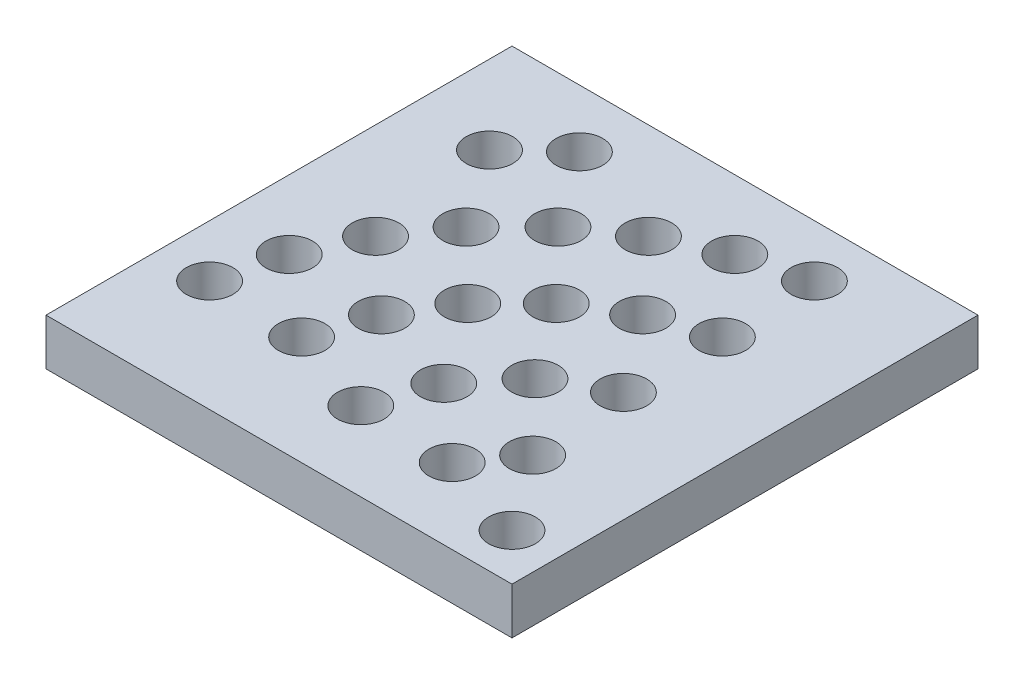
ISO-10303-21;
HEADER;
FILE_DESCRIPTION(('STEP AP214'),'2;1');
FILE_NAME('part.step','',(''),(''),'','','');
FILE_SCHEMA(('AUTOMOTIVE_DESIGN { 1 0 10303 214 1 1 1 1 }'));
ENDSEC;
DATA;
#1=APPLICATION_CONTEXT('core data for automotive mechanical design processes');
#2=APPLICATION_PROTOCOL_DEFINITION('international standard','automotive_design',2000,#1);
#3=PRODUCT_CONTEXT('',#1,'mechanical');
#4=PRODUCT('Part','Part','',(#3));
#5=PRODUCT_RELATED_PRODUCT_CATEGORY('part','',(#4));
#6=PRODUCT_DEFINITION_FORMATION('','',#4);
#7=PRODUCT_DEFINITION_CONTEXT('part definition',#1,'design');
#8=PRODUCT_DEFINITION('design','',#6,#7);
#9=PRODUCT_DEFINITION_SHAPE('','',#8);
#10=(LENGTH_UNIT() NAMED_UNIT(*) SI_UNIT(.MILLI.,.METRE.));
#11=(NAMED_UNIT(*) PLANE_ANGLE_UNIT() SI_UNIT($,.RADIAN.));
#12=(NAMED_UNIT(*) SI_UNIT($,.STERADIAN.) SOLID_ANGLE_UNIT());
#13=UNCERTAINTY_MEASURE_WITH_UNIT(LENGTH_MEASURE(1.E-05),#10,'distance_accuracy_value','');
#14=(GEOMETRIC_REPRESENTATION_CONTEXT(3) GLOBAL_UNCERTAINTY_ASSIGNED_CONTEXT((#13)) GLOBAL_UNIT_ASSIGNED_CONTEXT((#10,
#11,#12)) REPRESENTATION_CONTEXT('',''));
#15=CARTESIAN_POINT('',(0.,0.,0.));
#16=DIRECTION('',(0.,0.,1.));
#17=DIRECTION('',(1.,0.,0.));
#18=AXIS2_PLACEMENT_3D('',#15,#16,#17);
#19=CARTESIAN_POINT('',(0.,5.,0.));
#20=DIRECTION('',(-1.,0.,0.));
#21=DIRECTION('',(0.,0.,1.));
#22=AXIS2_PLACEMENT_3D('',#19,#20,#21);
#23=PLANE('',#22);
#24=DIRECTION('',(0.,0.,-1.));
#25=VECTOR('',#24,1.);
#26=CARTESIAN_POINT('',(0.,0.,0.));
#27=LINE('',#26,#25);
#28=CARTESIAN_POINT('',(0.,0.,0.));
#29=VERTEX_POINT('',#28);
#30=CARTESIAN_POINT('',(0.,0.,-50.));
#31=VERTEX_POINT('',#30);
#32=EDGE_CURVE('E82',#29,#31,#27,.T.);
#33=ORIENTED_EDGE('',*,*,#32,.T.);
#34=DIRECTION('',(0.,-1.,0.));
#35=VECTOR('',#34,1.);
#36=CARTESIAN_POINT('',(0.,5.,-50.));
#37=LINE('',#36,#35);
#38=CARTESIAN_POINT('',(0.,5.,-50.));
#39=VERTEX_POINT('',#38);
#40=EDGE_CURVE('E89',#39,#31,#37,.T.);
#41=ORIENTED_EDGE('',*,*,#40,.F.);
#42=DIRECTION('',(0.,0.,-1.));
#43=VECTOR('',#42,1.);
#44=CARTESIAN_POINT('',(0.,5.,0.));
#45=LINE('',#44,#43);
#46=CARTESIAN_POINT('',(0.,5.,0.));
#47=VERTEX_POINT('',#46);
#48=EDGE_CURVE('E110',#47,#39,#45,.T.);
#49=ORIENTED_EDGE('',*,*,#48,.F.);
#50=DIRECTION('',(0.,-1.,0.));
#51=VECTOR('',#50,1.);
#52=CARTESIAN_POINT('',(0.,5.,0.));
#53=LINE('',#52,#51);
#54=EDGE_CURVE('E98',#47,#29,#53,.T.);
#55=ORIENTED_EDGE('',*,*,#54,.T.);
#56=EDGE_LOOP('',(#33,#41,#49,#55));
#57=FACE_BOUND('',#56,.T.);
#58=ADVANCED_FACE('F35',(#57),#23,.F.);
#59=CARTESIAN_POINT('',(0.,5.,-50.));
#60=DIRECTION('',(0.,0.,1.));
#61=DIRECTION('',(1.,0.,0.));
#62=AXIS2_PLACEMENT_3D('',#59,#60,#61);
#63=PLANE('',#62);
#64=DIRECTION('',(-1.,0.,0.));
#65=VECTOR('',#64,1.);
#66=CARTESIAN_POINT('',(0.,0.,-50.));
#67=LINE('',#66,#65);
#68=CARTESIAN_POINT('',(-50.,0.,-50.));
#69=VERTEX_POINT('',#68);
#70=EDGE_CURVE('E76',#31,#69,#67,.T.);
#71=ORIENTED_EDGE('',*,*,#70,.T.);
#72=DIRECTION('',(0.,-1.,0.));
#73=VECTOR('',#72,1.);
#74=CARTESIAN_POINT('',(-50.,5.,-50.));
#75=LINE('',#74,#73);
#76=CARTESIAN_POINT('',(-50.,5.,-50.));
#77=VERTEX_POINT('',#76);
#78=EDGE_CURVE('E95',#77,#69,#75,.T.);
#79=ORIENTED_EDGE('',*,*,#78,.F.);
#80=DIRECTION('',(-1.,0.,0.));
#81=VECTOR('',#80,1.);
#82=CARTESIAN_POINT('',(0.,5.,-50.));
#83=LINE('',#82,#81);
#84=EDGE_CURVE('E91',#39,#77,#83,.T.);
#85=ORIENTED_EDGE('',*,*,#84,.F.);
#86=ORIENTED_EDGE('',*,*,#40,.T.);
#87=EDGE_LOOP('',(#71,#79,#85,#86));
#88=FACE_BOUND('',#87,.T.);
#89=ADVANCED_FACE('F90',(#88),#63,.F.);
#90=CARTESIAN_POINT('',(-50.,5.,0.));
#91=DIRECTION('',(1.,0.,0.));
#92=DIRECTION('',(0.,0.,-1.));
#93=AXIS2_PLACEMENT_3D('',#90,#91,#92);
#94=PLANE('',#93);
#95=DIRECTION('',(0.,0.,1.));
#96=VECTOR('',#95,1.);
#97=CARTESIAN_POINT('',(-50.,0.,0.));
#98=LINE('',#97,#96);
#99=CARTESIAN_POINT('',(-50.,0.,0.));
#100=VERTEX_POINT('',#99);
#101=EDGE_CURVE('E83',#69,#100,#98,.T.);
#102=ORIENTED_EDGE('',*,*,#101,.T.);
#103=DIRECTION('',(0.,-1.,0.));
#104=VECTOR('',#103,1.);
#105=CARTESIAN_POINT('',(-50.,5.,0.));
#106=LINE('',#105,#104);
#107=CARTESIAN_POINT('',(-50.,5.,0.));
#108=VERTEX_POINT('',#107);
#109=EDGE_CURVE('E116',#108,#100,#106,.T.);
#110=ORIENTED_EDGE('',*,*,#109,.F.);
#111=DIRECTION('',(0.,0.,1.));
#112=VECTOR('',#111,1.);
#113=CARTESIAN_POINT('',(-50.,5.,0.));
#114=LINE('',#113,#112);
#115=EDGE_CURVE('E55',#77,#108,#114,.T.);
#116=ORIENTED_EDGE('',*,*,#115,.F.);
#117=ORIENTED_EDGE('',*,*,#78,.T.);
#118=EDGE_LOOP('',(#102,#110,#116,#117));
#119=FACE_BOUND('',#118,.T.);
#120=ADVANCED_FACE('F255',(#119),#94,.F.);
#121=CARTESIAN_POINT('',(0.,5.,0.));
#122=DIRECTION('',(0.,0.,-1.));
#123=DIRECTION('',(-1.,0.,0.));
#124=AXIS2_PLACEMENT_3D('',#121,#122,#123);
#125=PLANE('',#124);
#126=DIRECTION('',(1.,0.,0.));
#127=VECTOR('',#126,1.);
#128=CARTESIAN_POINT('',(0.,0.,0.));
#129=LINE('',#128,#127);
#130=EDGE_CURVE('E108',#100,#29,#129,.T.);
#131=ORIENTED_EDGE('',*,*,#130,.T.);
#132=ORIENTED_EDGE('',*,*,#54,.F.);
#133=DIRECTION('',(1.,0.,0.));
#134=VECTOR('',#133,1.);
#135=CARTESIAN_POINT('',(0.,5.,0.));
#136=LINE('',#135,#134);
#137=EDGE_CURVE('E50',#108,#47,#136,.T.);
#138=ORIENTED_EDGE('',*,*,#137,.F.);
#139=ORIENTED_EDGE('',*,*,#109,.T.);
#140=EDGE_LOOP('',(#131,#132,#138,#139));
#141=FACE_BOUND('',#140,.T.);
#142=ADVANCED_FACE('F245',(#141),#125,.F.);
#143=CARTESIAN_POINT('',(0.,5.,0.));
#144=DIRECTION('',(0.,1.,0.));
#145=DIRECTION('',(0.,0.,1.));
#146=AXIS2_PLACEMENT_3D('',#143,#144,#145);
#147=PLANE('',#146);
#148=CARTESIAN_POINT('',(-14.5105651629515,5.,-8.09016994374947));
#149=DIRECTION('',(0.,1.,0.));
#150=DIRECTION('',(0.,0.,1.));
#151=AXIS2_PLACEMENT_3D('',#148,#149,#150);
#152=CIRCLE('',#151,2.5);
#153=CARTESIAN_POINT('',(-14.5105651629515,5.,-5.59016994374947));
#154=VERTEX_POINT('',#153);
#155=EDGE_CURVE('E634',#154,#154,#152,.T.);
#156=ORIENTED_EDGE('',*,*,#155,.F.);
#157=EDGE_LOOP('',(#156));
#158=FACE_BOUND('',#157,.T.);
#159=CARTESIAN_POINT('',(-5.,5.,-4.99999999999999));
#160=DIRECTION('',(0.,1.,0.));
#161=DIRECTION('',(0.,0.,1.));
#162=AXIS2_PLACEMENT_3D('',#159,#160,#161);
#163=CIRCLE('',#162,2.5);
#164=CARTESIAN_POINT('',(-5.,5.,-2.49999999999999));
#165=VERTEX_POINT('',#164);
#166=EDGE_CURVE('E102',#165,#165,#163,.T.);
#167=ORIENTED_EDGE('',*,*,#166,.F.);
#168=EDGE_LOOP('',(#167));
#169=FACE_BOUND('',#168,.T.);
#170=ORIENTED_EDGE('',*,*,#48,.T.);
#171=ORIENTED_EDGE('',*,*,#84,.T.);
#172=ORIENTED_EDGE('',*,*,#115,.T.);
#173=ORIENTED_EDGE('',*,*,#137,.T.);
#174=EDGE_LOOP('',(#170,#171,#172,#173));
#175=FACE_BOUND('',#174,.T.);
#176=CARTESIAN_POINT('',(-10.8778525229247,5.,-13.0901699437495));
#177=DIRECTION('',(0.,1.,0.));
#178=DIRECTION('',(0.,0.,1.));
#179=AXIS2_PLACEMENT_3D('',#176,#177,#178);
#180=CIRCLE('',#179,2.5);
#181=CARTESIAN_POINT('',(-10.8778525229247,5.,-10.5901699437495));
#182=VERTEX_POINT('',#181);
#183=EDGE_CURVE('E94',#182,#182,#180,.T.);
#184=ORIENTED_EDGE('',*,*,#183,.F.);
#185=EDGE_LOOP('',(#184));
#186=FACE_BOUND('',#185,.T.);
#187=CARTESIAN_POINT('',(-24.6961550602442,5.,-8.4729635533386));
#188=DIRECTION('',(0.,1.,0.));
#189=DIRECTION('',(0.,0.,1.));
#190=AXIS2_PLACEMENT_3D('',#187,#188,#189);
#191=CIRCLE('',#190,2.5);
#192=CARTESIAN_POINT('',(-24.6961550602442,5.,-5.97296355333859));
#193=VERTEX_POINT('',#192);
#194=EDGE_CURVE('E125',#193,#193,#191,.T.);
#195=ORIENTED_EDGE('',*,*,#194,.F.);
#196=EDGE_LOOP('',(#195));
#197=FACE_BOUND('',#196,.T.);
#198=CARTESIAN_POINT('',(-22.3205080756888,5.,-15.));
#199=DIRECTION('',(0.,1.,0.));
#200=DIRECTION('',(0.,0.,1.));
#201=AXIS2_PLACEMENT_3D('',#198,#199,#200);
#202=CIRCLE('',#201,2.5);
#203=CARTESIAN_POINT('',(-22.3205080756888,5.,-12.5));
#204=VERTEX_POINT('',#203);
#205=EDGE_CURVE('E131',#204,#204,#202,.T.);
#206=ORIENTED_EDGE('',*,*,#205,.F.);
#207=EDGE_LOOP('',(#206));
#208=FACE_BOUND('',#207,.T.);
#209=CARTESIAN_POINT('',(-17.8557521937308,5.,-20.3208888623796));
#210=DIRECTION('',(0.,1.,0.));
#211=DIRECTION('',(0.,0.,1.));
#212=AXIS2_PLACEMENT_3D('',#209,#210,#211);
#213=CIRCLE('',#212,2.5);
#214=CARTESIAN_POINT('',(-17.8557521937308,5.,-17.8208888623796));
#215=VERTEX_POINT('',#214);
#216=EDGE_CURVE('E137',#215,#215,#213,.T.);
#217=ORIENTED_EDGE('',*,*,#216,.F.);
#218=EDGE_LOOP('',(#217));
#219=FACE_BOUND('',#218,.T.);
#220=CARTESIAN_POINT('',(-11.8404028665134,5.,-23.7938524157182));
#221=DIRECTION('',(0.,1.,0.));
#222=DIRECTION('',(0.,0.,1.));
#223=AXIS2_PLACEMENT_3D('',#220,#221,#222);
#224=CIRCLE('',#223,2.5);
#225=CARTESIAN_POINT('',(-11.8404028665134,5.,-21.2938524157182));
#226=VERTEX_POINT('',#225);
#227=EDGE_CURVE('E143',#226,#226,#224,.T.);
#228=ORIENTED_EDGE('',*,*,#227,.F.);
#229=EDGE_LOOP('',(#228));
#230=FACE_BOUND('',#229,.T.);
#231=CARTESIAN_POINT('',(-34.2478373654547,5.,-11.6756280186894));
#232=DIRECTION('',(0.,1.,0.));
#233=DIRECTION('',(0.,0.,1.));
#234=AXIS2_PLACEMENT_3D('',#231,#232,#233);
#235=CIRCLE('',#234,2.5);
#236=CARTESIAN_POINT('',(-34.2478373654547,5.,-9.1756280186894));
#237=VERTEX_POINT('',#236);
#238=EDGE_CURVE('E149',#237,#237,#235,.T.);
#239=ORIENTED_EDGE('',*,*,#238,.F.);
#240=EDGE_LOOP('',(#239));
#241=FACE_BOUND('',#240,.T.);
#242=CARTESIAN_POINT('',(-32.0290660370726,5.,-18.0165121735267));
#243=DIRECTION('',(0.,1.,0.));
#244=DIRECTION('',(0.,0.,1.));
#245=AXIS2_PLACEMENT_3D('',#242,#243,#244);
#246=CIRCLE('',#245,2.5);
#247=CARTESIAN_POINT('',(-32.0290660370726,5.,-15.5165121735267));
#248=VERTEX_POINT('',#247);
#249=EDGE_CURVE('E155',#248,#248,#246,.T.);
#250=ORIENTED_EDGE('',*,*,#249,.F.);
#251=EDGE_LOOP('',(#250));
#252=FACE_BOUND('',#251,.T.);
#253=CARTESIAN_POINT('',(-28.4549444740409,5.,-23.704694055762));
#254=DIRECTION('',(0.,1.,0.));
#255=DIRECTION('',(0.,0.,1.));
#256=AXIS2_PLACEMENT_3D('',#253,#254,#255);
#257=CIRCLE('',#256,2.5);
#258=CARTESIAN_POINT('',(-28.4549444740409,5.,-21.204694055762));
#259=VERTEX_POINT('',#258);
#260=EDGE_CURVE('E161',#259,#259,#257,.T.);
#261=ORIENTED_EDGE('',*,*,#260,.F.);
#262=EDGE_LOOP('',(#261));
#263=FACE_BOUND('',#262,.T.);
#264=CARTESIAN_POINT('',(-23.704694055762,5.,-28.4549444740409));
#265=DIRECTION('',(0.,1.,0.));
#266=DIRECTION('',(0.,0.,1.));
#267=AXIS2_PLACEMENT_3D('',#264,#265,#266);
#268=CIRCLE('',#267,2.5);
#269=CARTESIAN_POINT('',(-23.704694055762,5.,-25.9549444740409));
#270=VERTEX_POINT('',#269);
#271=EDGE_CURVE('E167',#270,#270,#268,.T.);
#272=ORIENTED_EDGE('',*,*,#271,.F.);
#273=EDGE_LOOP('',(#272));
#274=FACE_BOUND('',#273,.T.);
#275=CARTESIAN_POINT('',(-18.0165121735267,5.,-32.0290660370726));
#276=DIRECTION('',(0.,1.,0.));
#277=DIRECTION('',(0.,0.,1.));
#278=AXIS2_PLACEMENT_3D('',#275,#276,#277);
#279=CIRCLE('',#278,2.5);
#280=CARTESIAN_POINT('',(-18.0165121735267,5.,-29.5290660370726));
#281=VERTEX_POINT('',#280);
#282=EDGE_CURVE('E173',#281,#281,#279,.T.);
#283=ORIENTED_EDGE('',*,*,#282,.F.);
#284=EDGE_LOOP('',(#283));
#285=FACE_BOUND('',#284,.T.);
#286=CARTESIAN_POINT('',(-11.6756280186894,5.,-34.2478373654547));
#287=DIRECTION('',(0.,1.,0.));
#288=DIRECTION('',(0.,0.,1.));
#289=AXIS2_PLACEMENT_3D('',#286,#287,#288);
#290=CIRCLE('',#289,2.5);
#291=CARTESIAN_POINT('',(-11.6756280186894,5.,-31.7478373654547));
#292=VERTEX_POINT('',#291);
#293=EDGE_CURVE('E179',#292,#292,#290,.T.);
#294=ORIENTED_EDGE('',*,*,#293,.F.);
#295=EDGE_LOOP('',(#294));
#296=FACE_BOUND('',#295,.T.);
#297=CARTESIAN_POINT('',(-44.3923101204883,5.,-11.9459271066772));
#298=DIRECTION('',(0.,1.,0.));
#299=DIRECTION('',(0.,0.,1.));
#300=AXIS2_PLACEMENT_3D('',#297,#298,#299);
#301=CIRCLE('',#300,2.5);
#302=CARTESIAN_POINT('',(-44.3923101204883,5.,-9.44592710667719));
#303=VERTEX_POINT('',#302);
#304=EDGE_CURVE('E185',#303,#303,#301,.T.);
#305=ORIENTED_EDGE('',*,*,#304,.F.);
#306=EDGE_LOOP('',(#305));
#307=FACE_BOUND('',#306,.T.);
#308=CARTESIAN_POINT('',(-42.5877048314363,5.,-18.6808057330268));
#309=DIRECTION('',(0.,1.,0.));
#310=DIRECTION('',(0.,0.,1.));
#311=AXIS2_PLACEMENT_3D('',#308,#309,#310);
#312=CIRCLE('',#311,2.5);
#313=CARTESIAN_POINT('',(-42.5877048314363,5.,-16.1808057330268));
#314=VERTEX_POINT('',#313);
#315=EDGE_CURVE('E191',#314,#314,#312,.T.);
#316=ORIENTED_EDGE('',*,*,#315,.F.);
#317=EDGE_LOOP('',(#316));
#318=FACE_BOUND('',#317,.T.);
#319=CARTESIAN_POINT('',(-39.6410161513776,5.,-25.));
#320=DIRECTION('',(0.,1.,0.));
#321=DIRECTION('',(0.,0.,1.));
#322=AXIS2_PLACEMENT_3D('',#319,#320,#321);
#323=CIRCLE('',#322,2.5);
#324=CARTESIAN_POINT('',(-39.6410161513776,5.,-22.5));
#325=VERTEX_POINT('',#324);
#326=EDGE_CURVE('E197',#325,#325,#323,.T.);
#327=ORIENTED_EDGE('',*,*,#326,.F.);
#328=EDGE_LOOP('',(#327));
#329=FACE_BOUND('',#328,.T.);
#330=CARTESIAN_POINT('',(-35.6417777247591,5.,-30.7115043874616));
#331=DIRECTION('',(0.,1.,0.));
#332=DIRECTION('',(0.,0.,1.));
#333=AXIS2_PLACEMENT_3D('',#330,#331,#332);
#334=CIRCLE('',#333,2.5);
#335=CARTESIAN_POINT('',(-35.6417777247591,5.,-28.2115043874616));
#336=VERTEX_POINT('',#335);
#337=EDGE_CURVE('E203',#336,#336,#334,.T.);
#338=ORIENTED_EDGE('',*,*,#337,.F.);
#339=EDGE_LOOP('',(#338));
#340=FACE_BOUND('',#339,.T.);
#341=CARTESIAN_POINT('',(-30.7115043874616,5.,-35.6417777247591));
#342=DIRECTION('',(0.,1.,0.));
#343=DIRECTION('',(0.,0.,1.));
#344=AXIS2_PLACEMENT_3D('',#341,#342,#343);
#345=CIRCLE('',#344,2.5);
#346=CARTESIAN_POINT('',(-30.7115043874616,5.,-33.1417777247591));
#347=VERTEX_POINT('',#346);
#348=EDGE_CURVE('E209',#347,#347,#345,.T.);
#349=ORIENTED_EDGE('',*,*,#348,.F.);
#350=EDGE_LOOP('',(#349));
#351=FACE_BOUND('',#350,.T.);
#352=CARTESIAN_POINT('',(-25.,5.,-39.6410161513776));
#353=DIRECTION('',(0.,1.,0.));
#354=DIRECTION('',(0.,0.,1.));
#355=AXIS2_PLACEMENT_3D('',#352,#353,#354);
#356=CIRCLE('',#355,2.5);
#357=CARTESIAN_POINT('',(-25.,5.,-37.1410161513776));
#358=VERTEX_POINT('',#357);
#359=EDGE_CURVE('E215',#358,#358,#356,.T.);
#360=ORIENTED_EDGE('',*,*,#359,.F.);
#361=EDGE_LOOP('',(#360));
#362=FACE_BOUND('',#361,.T.);
#363=CARTESIAN_POINT('',(-18.6808057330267,5.,-42.5877048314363));
#364=DIRECTION('',(0.,1.,0.));
#365=DIRECTION('',(0.,0.,1.));
#366=AXIS2_PLACEMENT_3D('',#363,#364,#365);
#367=CIRCLE('',#366,2.5);
#368=CARTESIAN_POINT('',(-18.6808057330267,5.,-40.0877048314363));
#369=VERTEX_POINT('',#368);
#370=EDGE_CURVE('E221',#369,#369,#367,.T.);
#371=ORIENTED_EDGE('',*,*,#370,.F.);
#372=EDGE_LOOP('',(#371));
#373=FACE_BOUND('',#372,.T.);
#374=CARTESIAN_POINT('',(-11.9459271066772,5.,-44.3923101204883));
#375=DIRECTION('',(0.,1.,0.));
#376=DIRECTION('',(0.,0.,1.));
#377=AXIS2_PLACEMENT_3D('',#374,#375,#376);
#378=CIRCLE('',#377,2.5);
#379=CARTESIAN_POINT('',(-11.9459271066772,5.,-41.8923101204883));
#380=VERTEX_POINT('',#379);
#381=EDGE_CURVE('E227',#380,#380,#378,.T.);
#382=ORIENTED_EDGE('',*,*,#381,.F.);
#383=EDGE_LOOP('',(#382));
#384=FACE_BOUND('',#383,.T.);
#385=CARTESIAN_POINT('',(-41.5417982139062,5.,-39.1276571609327));
#386=DIRECTION('',(0.,1.,0.));
#387=DIRECTION('',(0.,0.,1.));
#388=AXIS2_PLACEMENT_3D('',#385,#386,#387);
#389=CIRCLE('',#388,2.5);
#390=CARTESIAN_POINT('',(-41.5417982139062,5.,-36.6276571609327));
#391=VERTEX_POINT('',#390);
#392=EDGE_CURVE('E233',#391,#391,#389,.T.);
#393=ORIENTED_EDGE('',*,*,#392,.F.);
#394=EDGE_LOOP('',(#393));
#395=FACE_BOUND('',#394,.T.);
#396=CARTESIAN_POINT('',(-36.5543972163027,5.,-43.785564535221));
#397=DIRECTION('',(0.,1.,0.));
#398=DIRECTION('',(0.,0.,1.));
#399=AXIS2_PLACEMENT_3D('',#396,#397,#398);
#400=CIRCLE('',#399,2.5);
#401=CARTESIAN_POINT('',(-36.5543972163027,5.,-41.285564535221));
#402=VERTEX_POINT('',#401);
#403=EDGE_CURVE('E43',#402,#402,#400,.T.);
#404=ORIENTED_EDGE('',*,*,#403,.F.);
#405=EDGE_LOOP('',(#404));
#406=FACE_BOUND('',#405,.T.);
#407=ADVANCED_FACE('F243',(#158,#169,#175,#186,#197,#208,#219,#230,#241,#252,#263,#274,#285,
#296,#307,#318,#329,#340,#351,#362,#373,#384,#395,#406),#147,.T.);
#408=CARTESIAN_POINT('',(0.,0.,0.));
#409=DIRECTION('',(0.,1.,0.));
#410=DIRECTION('',(0.,0.,1.));
#411=AXIS2_PLACEMENT_3D('',#408,#409,#410);
#412=PLANE('',#411);
#413=CARTESIAN_POINT('',(-14.5105651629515,0.,-8.09016994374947));
#414=DIRECTION('',(0.,1.,0.));
#415=DIRECTION('',(0.,0.,1.));
#416=AXIS2_PLACEMENT_3D('',#413,#414,#415);
#417=CIRCLE('',#416,2.5);
#418=CARTESIAN_POINT('',(-14.5105651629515,0.,-5.59016994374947));
#419=VERTEX_POINT('',#418);
#420=EDGE_CURVE('E632',#419,#419,#417,.T.);
#421=ORIENTED_EDGE('',*,*,#420,.T.);
#422=EDGE_LOOP('',(#421));
#423=FACE_BOUND('',#422,.T.);
#424=CARTESIAN_POINT('',(-5.,0.,-4.99999999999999));
#425=DIRECTION('',(0.,1.,0.));
#426=DIRECTION('',(0.,0.,1.));
#427=AXIS2_PLACEMENT_3D('',#424,#425,#426);
#428=CIRCLE('',#427,2.5);
#429=CARTESIAN_POINT('',(-5.,0.,-2.49999999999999));
#430=VERTEX_POINT('',#429);
#431=EDGE_CURVE('E99',#430,#430,#428,.T.);
#432=ORIENTED_EDGE('',*,*,#431,.T.);
#433=EDGE_LOOP('',(#432));
#434=FACE_BOUND('',#433,.T.);
#435=ORIENTED_EDGE('',*,*,#32,.F.);
#436=ORIENTED_EDGE('',*,*,#130,.F.);
#437=ORIENTED_EDGE('',*,*,#101,.F.);
#438=ORIENTED_EDGE('',*,*,#70,.F.);
#439=EDGE_LOOP('',(#435,#436,#437,#438));
#440=FACE_BOUND('',#439,.T.);
#441=CARTESIAN_POINT('',(-10.8778525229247,0.,-13.0901699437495));
#442=DIRECTION('',(0.,1.,0.));
#443=DIRECTION('',(0.,0.,1.));
#444=AXIS2_PLACEMENT_3D('',#441,#442,#443);
#445=CIRCLE('',#444,2.5);
#446=CARTESIAN_POINT('',(-10.8778525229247,0.,-10.5901699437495));
#447=VERTEX_POINT('',#446);
#448=EDGE_CURVE('E122',#447,#447,#445,.T.);
#449=ORIENTED_EDGE('',*,*,#448,.T.);
#450=EDGE_LOOP('',(#449));
#451=FACE_BOUND('',#450,.T.);
#452=CARTESIAN_POINT('',(-24.6961550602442,0.,-8.4729635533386));
#453=DIRECTION('',(0.,1.,0.));
#454=DIRECTION('',(0.,0.,1.));
#455=AXIS2_PLACEMENT_3D('',#452,#453,#454);
#456=CIRCLE('',#455,2.5);
#457=CARTESIAN_POINT('',(-24.6961550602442,0.,-5.97296355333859));
#458=VERTEX_POINT('',#457);
#459=EDGE_CURVE('E128',#458,#458,#456,.T.);
#460=ORIENTED_EDGE('',*,*,#459,.T.);
#461=EDGE_LOOP('',(#460));
#462=FACE_BOUND('',#461,.T.);
#463=CARTESIAN_POINT('',(-22.3205080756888,0.,-15.));
#464=DIRECTION('',(0.,1.,0.));
#465=DIRECTION('',(0.,0.,1.));
#466=AXIS2_PLACEMENT_3D('',#463,#464,#465);
#467=CIRCLE('',#466,2.5);
#468=CARTESIAN_POINT('',(-22.3205080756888,0.,-12.5));
#469=VERTEX_POINT('',#468);
#470=EDGE_CURVE('E134',#469,#469,#467,.T.);
#471=ORIENTED_EDGE('',*,*,#470,.T.);
#472=EDGE_LOOP('',(#471));
#473=FACE_BOUND('',#472,.T.);
#474=CARTESIAN_POINT('',(-17.8557521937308,0.,-20.3208888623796));
#475=DIRECTION('',(0.,1.,0.));
#476=DIRECTION('',(0.,0.,1.));
#477=AXIS2_PLACEMENT_3D('',#474,#475,#476);
#478=CIRCLE('',#477,2.5);
#479=CARTESIAN_POINT('',(-17.8557521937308,0.,-17.8208888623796));
#480=VERTEX_POINT('',#479);
#481=EDGE_CURVE('E140',#480,#480,#478,.T.);
#482=ORIENTED_EDGE('',*,*,#481,.T.);
#483=EDGE_LOOP('',(#482));
#484=FACE_BOUND('',#483,.T.);
#485=CARTESIAN_POINT('',(-11.8404028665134,0.,-23.7938524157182));
#486=DIRECTION('',(0.,1.,0.));
#487=DIRECTION('',(0.,0.,1.));
#488=AXIS2_PLACEMENT_3D('',#485,#486,#487);
#489=CIRCLE('',#488,2.5);
#490=CARTESIAN_POINT('',(-11.8404028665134,0.,-21.2938524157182));
#491=VERTEX_POINT('',#490);
#492=EDGE_CURVE('E146',#491,#491,#489,.T.);
#493=ORIENTED_EDGE('',*,*,#492,.T.);
#494=EDGE_LOOP('',(#493));
#495=FACE_BOUND('',#494,.T.);
#496=CARTESIAN_POINT('',(-34.2478373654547,0.,-11.6756280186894));
#497=DIRECTION('',(0.,1.,0.));
#498=DIRECTION('',(0.,0.,1.));
#499=AXIS2_PLACEMENT_3D('',#496,#497,#498);
#500=CIRCLE('',#499,2.5);
#501=CARTESIAN_POINT('',(-34.2478373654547,0.,-9.1756280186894));
#502=VERTEX_POINT('',#501);
#503=EDGE_CURVE('E152',#502,#502,#500,.T.);
#504=ORIENTED_EDGE('',*,*,#503,.T.);
#505=EDGE_LOOP('',(#504));
#506=FACE_BOUND('',#505,.T.);
#507=CARTESIAN_POINT('',(-32.0290660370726,0.,-18.0165121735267));
#508=DIRECTION('',(0.,1.,0.));
#509=DIRECTION('',(0.,0.,1.));
#510=AXIS2_PLACEMENT_3D('',#507,#508,#509);
#511=CIRCLE('',#510,2.5);
#512=CARTESIAN_POINT('',(-32.0290660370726,0.,-15.5165121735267));
#513=VERTEX_POINT('',#512);
#514=EDGE_CURVE('E158',#513,#513,#511,.T.);
#515=ORIENTED_EDGE('',*,*,#514,.T.);
#516=EDGE_LOOP('',(#515));
#517=FACE_BOUND('',#516,.T.);
#518=CARTESIAN_POINT('',(-28.4549444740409,0.,-23.704694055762));
#519=DIRECTION('',(0.,1.,0.));
#520=DIRECTION('',(0.,0.,1.));
#521=AXIS2_PLACEMENT_3D('',#518,#519,#520);
#522=CIRCLE('',#521,2.5);
#523=CARTESIAN_POINT('',(-28.4549444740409,0.,-21.204694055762));
#524=VERTEX_POINT('',#523);
#525=EDGE_CURVE('E164',#524,#524,#522,.T.);
#526=ORIENTED_EDGE('',*,*,#525,.T.);
#527=EDGE_LOOP('',(#526));
#528=FACE_BOUND('',#527,.T.);
#529=CARTESIAN_POINT('',(-23.704694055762,0.,-28.4549444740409));
#530=DIRECTION('',(0.,1.,0.));
#531=DIRECTION('',(0.,0.,1.));
#532=AXIS2_PLACEMENT_3D('',#529,#530,#531);
#533=CIRCLE('',#532,2.5);
#534=CARTESIAN_POINT('',(-23.704694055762,0.,-25.9549444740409));
#535=VERTEX_POINT('',#534);
#536=EDGE_CURVE('E170',#535,#535,#533,.T.);
#537=ORIENTED_EDGE('',*,*,#536,.T.);
#538=EDGE_LOOP('',(#537));
#539=FACE_BOUND('',#538,.T.);
#540=CARTESIAN_POINT('',(-18.0165121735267,0.,-32.0290660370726));
#541=DIRECTION('',(0.,1.,0.));
#542=DIRECTION('',(0.,0.,1.));
#543=AXIS2_PLACEMENT_3D('',#540,#541,#542);
#544=CIRCLE('',#543,2.5);
#545=CARTESIAN_POINT('',(-18.0165121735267,0.,-29.5290660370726));
#546=VERTEX_POINT('',#545);
#547=EDGE_CURVE('E176',#546,#546,#544,.T.);
#548=ORIENTED_EDGE('',*,*,#547,.T.);
#549=EDGE_LOOP('',(#548));
#550=FACE_BOUND('',#549,.T.);
#551=CARTESIAN_POINT('',(-11.6756280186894,0.,-34.2478373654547));
#552=DIRECTION('',(0.,1.,0.));
#553=DIRECTION('',(0.,0.,1.));
#554=AXIS2_PLACEMENT_3D('',#551,#552,#553);
#555=CIRCLE('',#554,2.5);
#556=CARTESIAN_POINT('',(-11.6756280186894,0.,-31.7478373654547));
#557=VERTEX_POINT('',#556);
#558=EDGE_CURVE('E182',#557,#557,#555,.T.);
#559=ORIENTED_EDGE('',*,*,#558,.T.);
#560=EDGE_LOOP('',(#559));
#561=FACE_BOUND('',#560,.T.);
#562=CARTESIAN_POINT('',(-44.3923101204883,0.,-11.9459271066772));
#563=DIRECTION('',(0.,1.,0.));
#564=DIRECTION('',(0.,0.,1.));
#565=AXIS2_PLACEMENT_3D('',#562,#563,#564);
#566=CIRCLE('',#565,2.5);
#567=CARTESIAN_POINT('',(-44.3923101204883,0.,-9.44592710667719));
#568=VERTEX_POINT('',#567);
#569=EDGE_CURVE('E188',#568,#568,#566,.T.);
#570=ORIENTED_EDGE('',*,*,#569,.T.);
#571=EDGE_LOOP('',(#570));
#572=FACE_BOUND('',#571,.T.);
#573=CARTESIAN_POINT('',(-42.5877048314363,0.,-18.6808057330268));
#574=DIRECTION('',(0.,1.,0.));
#575=DIRECTION('',(0.,0.,1.));
#576=AXIS2_PLACEMENT_3D('',#573,#574,#575);
#577=CIRCLE('',#576,2.5);
#578=CARTESIAN_POINT('',(-42.5877048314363,0.,-16.1808057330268));
#579=VERTEX_POINT('',#578);
#580=EDGE_CURVE('E194',#579,#579,#577,.T.);
#581=ORIENTED_EDGE('',*,*,#580,.T.);
#582=EDGE_LOOP('',(#581));
#583=FACE_BOUND('',#582,.T.);
#584=CARTESIAN_POINT('',(-39.6410161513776,0.,-25.));
#585=DIRECTION('',(0.,1.,0.));
#586=DIRECTION('',(0.,0.,1.));
#587=AXIS2_PLACEMENT_3D('',#584,#585,#586);
#588=CIRCLE('',#587,2.5);
#589=CARTESIAN_POINT('',(-39.6410161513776,0.,-22.5));
#590=VERTEX_POINT('',#589);
#591=EDGE_CURVE('E200',#590,#590,#588,.T.);
#592=ORIENTED_EDGE('',*,*,#591,.T.);
#593=EDGE_LOOP('',(#592));
#594=FACE_BOUND('',#593,.T.);
#595=CARTESIAN_POINT('',(-35.6417777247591,0.,-30.7115043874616));
#596=DIRECTION('',(0.,1.,0.));
#597=DIRECTION('',(0.,0.,1.));
#598=AXIS2_PLACEMENT_3D('',#595,#596,#597);
#599=CIRCLE('',#598,2.5);
#600=CARTESIAN_POINT('',(-35.6417777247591,0.,-28.2115043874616));
#601=VERTEX_POINT('',#600);
#602=EDGE_CURVE('E206',#601,#601,#599,.T.);
#603=ORIENTED_EDGE('',*,*,#602,.T.);
#604=EDGE_LOOP('',(#603));
#605=FACE_BOUND('',#604,.T.);
#606=CARTESIAN_POINT('',(-30.7115043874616,0.,-35.6417777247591));
#607=DIRECTION('',(0.,1.,0.));
#608=DIRECTION('',(0.,0.,1.));
#609=AXIS2_PLACEMENT_3D('',#606,#607,#608);
#610=CIRCLE('',#609,2.5);
#611=CARTESIAN_POINT('',(-30.7115043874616,0.,-33.1417777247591));
#612=VERTEX_POINT('',#611);
#613=EDGE_CURVE('E212',#612,#612,#610,.T.);
#614=ORIENTED_EDGE('',*,*,#613,.T.);
#615=EDGE_LOOP('',(#614));
#616=FACE_BOUND('',#615,.T.);
#617=CARTESIAN_POINT('',(-25.,0.,-39.6410161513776));
#618=DIRECTION('',(0.,1.,0.));
#619=DIRECTION('',(0.,0.,1.));
#620=AXIS2_PLACEMENT_3D('',#617,#618,#619);
#621=CIRCLE('',#620,2.5);
#622=CARTESIAN_POINT('',(-25.,0.,-37.1410161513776));
#623=VERTEX_POINT('',#622);
#624=EDGE_CURVE('E218',#623,#623,#621,.T.);
#625=ORIENTED_EDGE('',*,*,#624,.T.);
#626=EDGE_LOOP('',(#625));
#627=FACE_BOUND('',#626,.T.);
#628=CARTESIAN_POINT('',(-18.6808057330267,0.,-42.5877048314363));
#629=DIRECTION('',(0.,1.,0.));
#630=DIRECTION('',(0.,0.,1.));
#631=AXIS2_PLACEMENT_3D('',#628,#629,#630);
#632=CIRCLE('',#631,2.5);
#633=CARTESIAN_POINT('',(-18.6808057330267,0.,-40.0877048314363));
#634=VERTEX_POINT('',#633);
#635=EDGE_CURVE('E224',#634,#634,#632,.T.);
#636=ORIENTED_EDGE('',*,*,#635,.T.);
#637=EDGE_LOOP('',(#636));
#638=FACE_BOUND('',#637,.T.);
#639=CARTESIAN_POINT('',(-11.9459271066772,0.,-44.3923101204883));
#640=DIRECTION('',(0.,1.,0.));
#641=DIRECTION('',(0.,0.,1.));
#642=AXIS2_PLACEMENT_3D('',#639,#640,#641);
#643=CIRCLE('',#642,2.5);
#644=CARTESIAN_POINT('',(-11.9459271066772,0.,-41.8923101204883));
#645=VERTEX_POINT('',#644);
#646=EDGE_CURVE('E230',#645,#645,#643,.T.);
#647=ORIENTED_EDGE('',*,*,#646,.T.);
#648=EDGE_LOOP('',(#647));
#649=FACE_BOUND('',#648,.T.);
#650=CARTESIAN_POINT('',(-41.5417982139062,0.,-39.1276571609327));
#651=DIRECTION('',(0.,1.,0.));
#652=DIRECTION('',(0.,0.,1.));
#653=AXIS2_PLACEMENT_3D('',#650,#651,#652);
#654=CIRCLE('',#653,2.5);
#655=CARTESIAN_POINT('',(-41.5417982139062,0.,-36.6276571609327));
#656=VERTEX_POINT('',#655);
#657=EDGE_CURVE('E236',#656,#656,#654,.T.);
#658=ORIENTED_EDGE('',*,*,#657,.T.);
#659=EDGE_LOOP('',(#658));
#660=FACE_BOUND('',#659,.T.);
#661=CARTESIAN_POINT('',(-36.5543972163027,0.,-43.785564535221));
#662=DIRECTION('',(0.,1.,0.));
#663=DIRECTION('',(0.,0.,1.));
#664=AXIS2_PLACEMENT_3D('',#661,#662,#663);
#665=CIRCLE('',#664,2.5);
#666=CARTESIAN_POINT('',(-36.5543972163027,0.,-41.285564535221));
#667=VERTEX_POINT('',#666);
#668=EDGE_CURVE('E12',#667,#667,#665,.T.);
#669=ORIENTED_EDGE('',*,*,#668,.T.);
#670=EDGE_LOOP('',(#669));
#671=FACE_BOUND('',#670,.T.);
#672=ADVANCED_FACE('F78',(#423,#434,#440,#451,#462,#473,#484,#495,#506,#517,#528,#539,#550,#561,
#572,#583,#594,#605,#616,#627,#638,#649,#660,#671),#412,.F.);
#673=CARTESIAN_POINT('',(-5.,-5.,-4.99999999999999));
#674=DIRECTION('',(0.,1.,0.));
#675=DIRECTION('',(0.,0.,1.));
#676=AXIS2_PLACEMENT_3D('',#673,#674,#675);
#677=CYLINDRICAL_SURFACE('',#676,2.5);
#678=ORIENTED_EDGE('',*,*,#166,.T.);
#679=EDGE_LOOP('',(#678));
#680=FACE_BOUND('',#679,.T.);
#681=ORIENTED_EDGE('',*,*,#431,.F.);
#682=EDGE_LOOP('',(#681));
#683=FACE_BOUND('',#682,.T.);
#684=ADVANCED_FACE('F252',(#680,#683),#677,.F.);
#685=CARTESIAN_POINT('',(-14.5105651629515,-5.,-8.09016994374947));
#686=DIRECTION('',(0.,1.,0.));
#687=DIRECTION('',(0.,0.,1.));
#688=AXIS2_PLACEMENT_3D('',#685,#686,#687);
#689=CYLINDRICAL_SURFACE('',#688,2.5);
#690=ORIENTED_EDGE('',*,*,#155,.T.);
#691=EDGE_LOOP('',(#690));
#692=FACE_BOUND('',#691,.T.);
#693=ORIENTED_EDGE('',*,*,#420,.F.);
#694=EDGE_LOOP('',(#693));
#695=FACE_BOUND('',#694,.T.);
#696=ADVANCED_FACE('F272',(#692,#695),#689,.F.);
#697=CARTESIAN_POINT('',(-10.8778525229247,-5.,-13.0901699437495));
#698=DIRECTION('',(0.,1.,0.));
#699=DIRECTION('',(0.,0.,1.));
#700=AXIS2_PLACEMENT_3D('',#697,#698,#699);
#701=CYLINDRICAL_SURFACE('',#700,2.5);
#702=ORIENTED_EDGE('',*,*,#183,.T.);
#703=EDGE_LOOP('',(#702));
#704=FACE_BOUND('',#703,.T.);
#705=ORIENTED_EDGE('',*,*,#448,.F.);
#706=EDGE_LOOP('',(#705));
#707=FACE_BOUND('',#706,.T.);
#708=ADVANCED_FACE('F268',(#704,#707),#701,.F.);
#709=CARTESIAN_POINT('',(-24.6961550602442,-5.,-8.4729635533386));
#710=DIRECTION('',(0.,1.,0.));
#711=DIRECTION('',(0.,0.,1.));
#712=AXIS2_PLACEMENT_3D('',#709,#710,#711);
#713=CYLINDRICAL_SURFACE('',#712,2.5);
#714=ORIENTED_EDGE('',*,*,#194,.T.);
#715=EDGE_LOOP('',(#714));
#716=FACE_BOUND('',#715,.T.);
#717=ORIENTED_EDGE('',*,*,#459,.F.);
#718=EDGE_LOOP('',(#717));
#719=FACE_BOUND('',#718,.T.);
#720=ADVANCED_FACE('F271',(#716,#719),#713,.F.);
#721=CARTESIAN_POINT('',(-22.3205080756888,-5.,-15.));
#722=DIRECTION('',(0.,1.,0.));
#723=DIRECTION('',(0.,0.,1.));
#724=AXIS2_PLACEMENT_3D('',#721,#722,#723);
#725=CYLINDRICAL_SURFACE('',#724,2.5);
#726=ORIENTED_EDGE('',*,*,#205,.T.);
#727=EDGE_LOOP('',(#726));
#728=FACE_BOUND('',#727,.T.);
#729=ORIENTED_EDGE('',*,*,#470,.F.);
#730=EDGE_LOOP('',(#729));
#731=FACE_BOUND('',#730,.T.);
#732=ADVANCED_FACE('F276',(#728,#731),#725,.F.);
#733=CARTESIAN_POINT('',(-17.8557521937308,-5.,-20.3208888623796));
#734=DIRECTION('',(0.,1.,0.));
#735=DIRECTION('',(0.,0.,1.));
#736=AXIS2_PLACEMENT_3D('',#733,#734,#735);
#737=CYLINDRICAL_SURFACE('',#736,2.5);
#738=ORIENTED_EDGE('',*,*,#216,.T.);
#739=EDGE_LOOP('',(#738));
#740=FACE_BOUND('',#739,.T.);
#741=ORIENTED_EDGE('',*,*,#481,.F.);
#742=EDGE_LOOP('',(#741));
#743=FACE_BOUND('',#742,.T.);
#744=ADVANCED_FACE('F280',(#740,#743),#737,.F.);
#745=CARTESIAN_POINT('',(-11.8404028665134,-5.,-23.7938524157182));
#746=DIRECTION('',(0.,1.,0.));
#747=DIRECTION('',(0.,0.,1.));
#748=AXIS2_PLACEMENT_3D('',#745,#746,#747);
#749=CYLINDRICAL_SURFACE('',#748,2.5);
#750=ORIENTED_EDGE('',*,*,#227,.T.);
#751=EDGE_LOOP('',(#750));
#752=FACE_BOUND('',#751,.T.);
#753=ORIENTED_EDGE('',*,*,#492,.F.);
#754=EDGE_LOOP('',(#753));
#755=FACE_BOUND('',#754,.T.);
#756=ADVANCED_FACE('F284',(#752,#755),#749,.F.);
#757=CARTESIAN_POINT('',(-34.2478373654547,-5.,-11.6756280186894));
#758=DIRECTION('',(0.,1.,0.));
#759=DIRECTION('',(0.,0.,1.));
#760=AXIS2_PLACEMENT_3D('',#757,#758,#759);
#761=CYLINDRICAL_SURFACE('',#760,2.5);
#762=ORIENTED_EDGE('',*,*,#238,.T.);
#763=EDGE_LOOP('',(#762));
#764=FACE_BOUND('',#763,.T.);
#765=ORIENTED_EDGE('',*,*,#503,.F.);
#766=EDGE_LOOP('',(#765));
#767=FACE_BOUND('',#766,.T.);
#768=ADVANCED_FACE('F288',(#764,#767),#761,.F.);
#769=CARTESIAN_POINT('',(-32.0290660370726,-5.,-18.0165121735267));
#770=DIRECTION('',(0.,1.,0.));
#771=DIRECTION('',(0.,0.,1.));
#772=AXIS2_PLACEMENT_3D('',#769,#770,#771);
#773=CYLINDRICAL_SURFACE('',#772,2.5);
#774=ORIENTED_EDGE('',*,*,#249,.T.);
#775=EDGE_LOOP('',(#774));
#776=FACE_BOUND('',#775,.T.);
#777=ORIENTED_EDGE('',*,*,#514,.F.);
#778=EDGE_LOOP('',(#777));
#779=FACE_BOUND('',#778,.T.);
#780=ADVANCED_FACE('F292',(#776,#779),#773,.F.);
#781=CARTESIAN_POINT('',(-28.4549444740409,-5.,-23.704694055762));
#782=DIRECTION('',(0.,1.,0.));
#783=DIRECTION('',(0.,0.,1.));
#784=AXIS2_PLACEMENT_3D('',#781,#782,#783);
#785=CYLINDRICAL_SURFACE('',#784,2.5);
#786=ORIENTED_EDGE('',*,*,#260,.T.);
#787=EDGE_LOOP('',(#786));
#788=FACE_BOUND('',#787,.T.);
#789=ORIENTED_EDGE('',*,*,#525,.F.);
#790=EDGE_LOOP('',(#789));
#791=FACE_BOUND('',#790,.T.);
#792=ADVANCED_FACE('F296',(#788,#791),#785,.F.);
#793=CARTESIAN_POINT('',(-23.704694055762,-5.,-28.4549444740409));
#794=DIRECTION('',(0.,1.,0.));
#795=DIRECTION('',(0.,0.,1.));
#796=AXIS2_PLACEMENT_3D('',#793,#794,#795);
#797=CYLINDRICAL_SURFACE('',#796,2.5);
#798=ORIENTED_EDGE('',*,*,#271,.T.);
#799=EDGE_LOOP('',(#798));
#800=FACE_BOUND('',#799,.T.);
#801=ORIENTED_EDGE('',*,*,#536,.F.);
#802=EDGE_LOOP('',(#801));
#803=FACE_BOUND('',#802,.T.);
#804=ADVANCED_FACE('F300',(#800,#803),#797,.F.);
#805=CARTESIAN_POINT('',(-18.0165121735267,-5.,-32.0290660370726));
#806=DIRECTION('',(0.,1.,0.));
#807=DIRECTION('',(0.,0.,1.));
#808=AXIS2_PLACEMENT_3D('',#805,#806,#807);
#809=CYLINDRICAL_SURFACE('',#808,2.5);
#810=ORIENTED_EDGE('',*,*,#282,.T.);
#811=EDGE_LOOP('',(#810));
#812=FACE_BOUND('',#811,.T.);
#813=ORIENTED_EDGE('',*,*,#547,.F.);
#814=EDGE_LOOP('',(#813));
#815=FACE_BOUND('',#814,.T.);
#816=ADVANCED_FACE('F304',(#812,#815),#809,.F.);
#817=CARTESIAN_POINT('',(-11.6756280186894,-5.,-34.2478373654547));
#818=DIRECTION('',(0.,1.,0.));
#819=DIRECTION('',(0.,0.,1.));
#820=AXIS2_PLACEMENT_3D('',#817,#818,#819);
#821=CYLINDRICAL_SURFACE('',#820,2.5);
#822=ORIENTED_EDGE('',*,*,#293,.T.);
#823=EDGE_LOOP('',(#822));
#824=FACE_BOUND('',#823,.T.);
#825=ORIENTED_EDGE('',*,*,#558,.F.);
#826=EDGE_LOOP('',(#825));
#827=FACE_BOUND('',#826,.T.);
#828=ADVANCED_FACE('F308',(#824,#827),#821,.F.);
#829=CARTESIAN_POINT('',(-44.3923101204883,-5.,-11.9459271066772));
#830=DIRECTION('',(0.,1.,0.));
#831=DIRECTION('',(0.,0.,1.));
#832=AXIS2_PLACEMENT_3D('',#829,#830,#831);
#833=CYLINDRICAL_SURFACE('',#832,2.5);
#834=ORIENTED_EDGE('',*,*,#304,.T.);
#835=EDGE_LOOP('',(#834));
#836=FACE_BOUND('',#835,.T.);
#837=ORIENTED_EDGE('',*,*,#569,.F.);
#838=EDGE_LOOP('',(#837));
#839=FACE_BOUND('',#838,.T.);
#840=ADVANCED_FACE('F312',(#836,#839),#833,.F.);
#841=CARTESIAN_POINT('',(-42.5877048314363,-5.,-18.6808057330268));
#842=DIRECTION('',(0.,1.,0.));
#843=DIRECTION('',(0.,0.,1.));
#844=AXIS2_PLACEMENT_3D('',#841,#842,#843);
#845=CYLINDRICAL_SURFACE('',#844,2.5);
#846=ORIENTED_EDGE('',*,*,#315,.T.);
#847=EDGE_LOOP('',(#846));
#848=FACE_BOUND('',#847,.T.);
#849=ORIENTED_EDGE('',*,*,#580,.F.);
#850=EDGE_LOOP('',(#849));
#851=FACE_BOUND('',#850,.T.);
#852=ADVANCED_FACE('F316',(#848,#851),#845,.F.);
#853=CARTESIAN_POINT('',(-39.6410161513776,-5.,-25.));
#854=DIRECTION('',(0.,1.,0.));
#855=DIRECTION('',(0.,0.,1.));
#856=AXIS2_PLACEMENT_3D('',#853,#854,#855);
#857=CYLINDRICAL_SURFACE('',#856,2.5);
#858=ORIENTED_EDGE('',*,*,#326,.T.);
#859=EDGE_LOOP('',(#858));
#860=FACE_BOUND('',#859,.T.);
#861=ORIENTED_EDGE('',*,*,#591,.F.);
#862=EDGE_LOOP('',(#861));
#863=FACE_BOUND('',#862,.T.);
#864=ADVANCED_FACE('F320',(#860,#863),#857,.F.);
#865=CARTESIAN_POINT('',(-35.6417777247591,-5.,-30.7115043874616));
#866=DIRECTION('',(0.,1.,0.));
#867=DIRECTION('',(0.,0.,1.));
#868=AXIS2_PLACEMENT_3D('',#865,#866,#867);
#869=CYLINDRICAL_SURFACE('',#868,2.5);
#870=ORIENTED_EDGE('',*,*,#337,.T.);
#871=EDGE_LOOP('',(#870));
#872=FACE_BOUND('',#871,.T.);
#873=ORIENTED_EDGE('',*,*,#602,.F.);
#874=EDGE_LOOP('',(#873));
#875=FACE_BOUND('',#874,.T.);
#876=ADVANCED_FACE('F324',(#872,#875),#869,.F.);
#877=CARTESIAN_POINT('',(-30.7115043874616,-5.,-35.6417777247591));
#878=DIRECTION('',(0.,1.,0.));
#879=DIRECTION('',(0.,0.,1.));
#880=AXIS2_PLACEMENT_3D('',#877,#878,#879);
#881=CYLINDRICAL_SURFACE('',#880,2.5);
#882=ORIENTED_EDGE('',*,*,#348,.T.);
#883=EDGE_LOOP('',(#882));
#884=FACE_BOUND('',#883,.T.);
#885=ORIENTED_EDGE('',*,*,#613,.F.);
#886=EDGE_LOOP('',(#885));
#887=FACE_BOUND('',#886,.T.);
#888=ADVANCED_FACE('F328',(#884,#887),#881,.F.);
#889=CARTESIAN_POINT('',(-25.,-5.,-39.6410161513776));
#890=DIRECTION('',(0.,1.,0.));
#891=DIRECTION('',(0.,0.,1.));
#892=AXIS2_PLACEMENT_3D('',#889,#890,#891);
#893=CYLINDRICAL_SURFACE('',#892,2.5);
#894=ORIENTED_EDGE('',*,*,#359,.T.);
#895=EDGE_LOOP('',(#894));
#896=FACE_BOUND('',#895,.T.);
#897=ORIENTED_EDGE('',*,*,#624,.F.);
#898=EDGE_LOOP('',(#897));
#899=FACE_BOUND('',#898,.T.);
#900=ADVANCED_FACE('F332',(#896,#899),#893,.F.);
#901=CARTESIAN_POINT('',(-18.6808057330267,-5.,-42.5877048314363));
#902=DIRECTION('',(0.,1.,0.));
#903=DIRECTION('',(0.,0.,1.));
#904=AXIS2_PLACEMENT_3D('',#901,#902,#903);
#905=CYLINDRICAL_SURFACE('',#904,2.5);
#906=ORIENTED_EDGE('',*,*,#370,.T.);
#907=EDGE_LOOP('',(#906));
#908=FACE_BOUND('',#907,.T.);
#909=ORIENTED_EDGE('',*,*,#635,.F.);
#910=EDGE_LOOP('',(#909));
#911=FACE_BOUND('',#910,.T.);
#912=ADVANCED_FACE('F336',(#908,#911),#905,.F.);
#913=CARTESIAN_POINT('',(-11.9459271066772,-5.,-44.3923101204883));
#914=DIRECTION('',(0.,1.,0.));
#915=DIRECTION('',(0.,0.,1.));
#916=AXIS2_PLACEMENT_3D('',#913,#914,#915);
#917=CYLINDRICAL_SURFACE('',#916,2.5);
#918=ORIENTED_EDGE('',*,*,#381,.T.);
#919=EDGE_LOOP('',(#918));
#920=FACE_BOUND('',#919,.T.);
#921=ORIENTED_EDGE('',*,*,#646,.F.);
#922=EDGE_LOOP('',(#921));
#923=FACE_BOUND('',#922,.T.);
#924=ADVANCED_FACE('F340',(#920,#923),#917,.F.);
#925=CARTESIAN_POINT('',(-41.5417982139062,-5.,-39.1276571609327));
#926=DIRECTION('',(0.,1.,0.));
#927=DIRECTION('',(0.,0.,1.));
#928=AXIS2_PLACEMENT_3D('',#925,#926,#927);
#929=CYLINDRICAL_SURFACE('',#928,2.5);
#930=ORIENTED_EDGE('',*,*,#392,.T.);
#931=EDGE_LOOP('',(#930));
#932=FACE_BOUND('',#931,.T.);
#933=ORIENTED_EDGE('',*,*,#657,.F.);
#934=EDGE_LOOP('',(#933));
#935=FACE_BOUND('',#934,.T.);
#936=ADVANCED_FACE('F343',(#932,#935),#929,.F.);
#937=CARTESIAN_POINT('',(-36.5543972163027,-5.,-43.785564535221));
#938=DIRECTION('',(0.,1.,0.));
#939=DIRECTION('',(0.,0.,1.));
#940=AXIS2_PLACEMENT_3D('',#937,#938,#939);
#941=CYLINDRICAL_SURFACE('',#940,2.5);
#942=ORIENTED_EDGE('',*,*,#403,.T.);
#943=EDGE_LOOP('',(#942));
#944=FACE_BOUND('',#943,.T.);
#945=ORIENTED_EDGE('',*,*,#668,.F.);
#946=EDGE_LOOP('',(#945));
#947=FACE_BOUND('',#946,.T.);
#948=ADVANCED_FACE('F37',(#944,#947),#941,.F.);
#949=CLOSED_SHELL('',(#58,#89,#120,#142,#407,#672,#684,#696,#708,#720,#732,#744,#756,#768,#780,
#792,#804,#816,#828,#840,#852,#864,#876,#888,#900,#912,#924,#936,#948));
#950=MANIFOLD_SOLID_BREP('B2',#949);
#951=ADVANCED_BREP_SHAPE_REPRESENTATION('',(#18,#950),#14);
#952=SHAPE_DEFINITION_REPRESENTATION(#9,#951);
ENDSEC;
END-ISO-10303-21;
